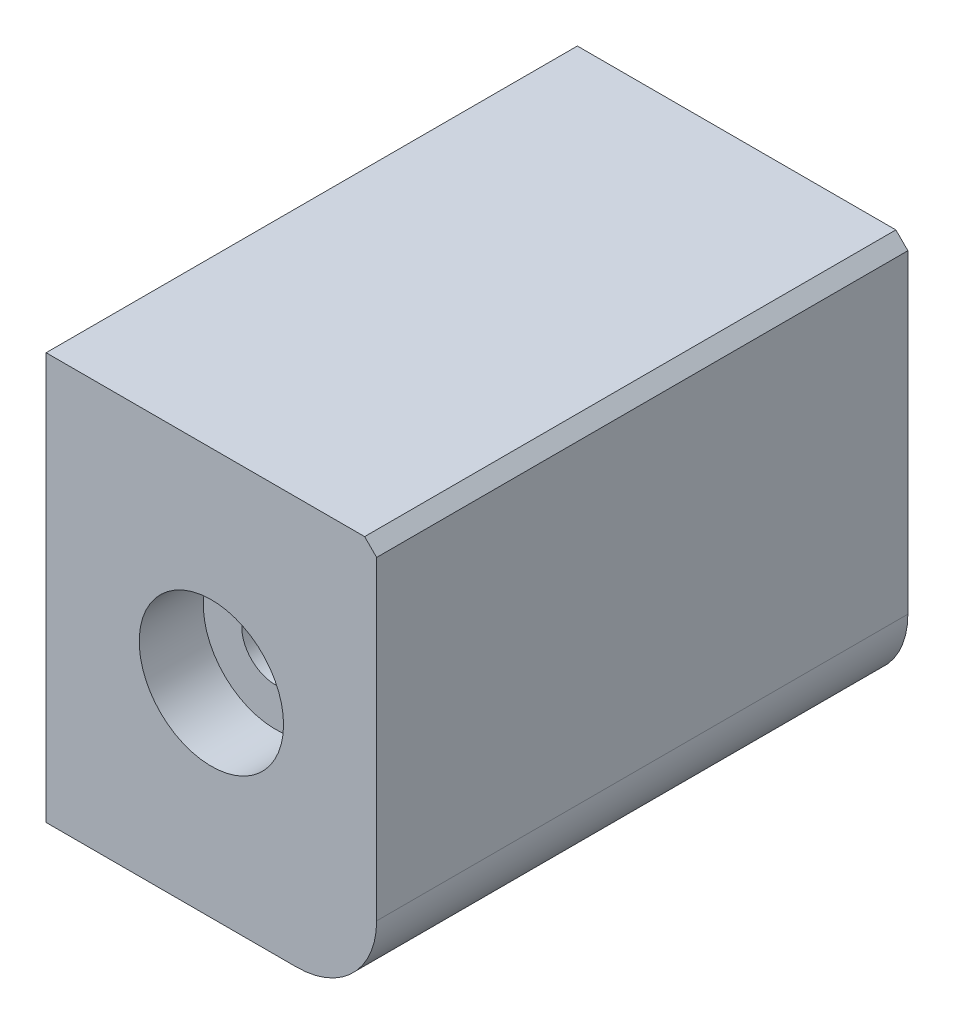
from build123d import *

# Parameters (mm, degrees)
EXTRUDE1_DEPTH     = 66.33
SKETCH2_R          = 9.01
CUT_EXTRUDE1_DEPTH = 8
SKETCH3_R          = 4.2
CUT_EXTRUDE2_DEPTH = 15.5
SKETCH5_R          = 4.2
CUT_EXTRUDE5_DEPTH = 22
CUT_EXTRUDE6_START = -8
SKETCH6_R          = 9.01
SKETCH6_R_2        = 3
CUT_EXTRUDE6_DEPTH = 8
CHAMFER2_SIZE      = 1.5


with BuildPart() as part:
    # Sketch1 → Extrude1 (new body)
    with BuildSketch(Plane.XY):
        with BuildLine():
            Line((41.27, -40.8), (41.27, 0))
            Line((41.27, 0), (0, 0))
            Line((0, 0), (0, -50.8))
            Line((0, -50.8), (31.27, -50.8))
            ThreePointArc((31.27, -50.8), (38.341067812, -47.871067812), (41.27, -40.8))
        make_face()
    extrude(amount=EXTRUDE1_DEPTH)

    # Sketch2 → Cut-Extrude1 (cut)
    with BuildSketch(Plane.XY.offset(66.33)):
        with Locations((20.635, -25.4)):
            Circle(SKETCH2_R)
    extrude(amount=-CUT_EXTRUDE1_DEPTH, mode=Mode.SUBTRACT)

    # Sketch3 → Cut-Extrude2 (cut)
    with BuildSketch(Plane.XY.offset(58.33)):
        with Locations((20.625, -25.4)):
            Circle(SKETCH3_R)
    extrude(amount=-CUT_EXTRUDE2_DEPTH, mode=Mode.SUBTRACT)

    # Cut-Extrude4 cone 1 section (on through the dimple's axis) → Cut-Extrude4 (revolve, cut)
    with BuildSketch(Plane(origin=(20.625, -25.4, 42.83), x_dir=(0, -1, 0), z_dir=(1, 0, 0))):
        Polygon((0, 0), (4.2, 0), (0, 2.424871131), align=None)
    revolve(axis=Axis((20.625, -25.4, 42.83), (0, 0, -1)), mode=Mode.SUBTRACT)

    # Sketch5 → Cut-Extrude5 (cut)
    with BuildSketch(Plane(origin=(0, 0, 0), x_dir=(-1, 0, 0), z_dir=(0, 0, -1))):
        with Locations((-20.635, -25.4)):
            Circle(SKETCH5_R)
    extrude(amount=-CUT_EXTRUDE5_DEPTH, mode=Mode.SUBTRACT)

    # Sketch6 → Cut-Extrude6 (cut)
    with BuildSketch(Plane(origin=(0, 0, 0), x_dir=(-1, 0, 0), z_dir=(0, 0, -1)).offset(CUT_EXTRUDE6_START)):
        with Locations(Location((-20.635, -25.4, 0), (0, 0, 180))):
            Circle(SKETCH6_R)
        with Locations((-20.635, -39.4)):
            Circle(SKETCH6_R_2)
    extrude(amount=CUT_EXTRUDE6_DEPTH, mode=Mode.SUBTRACT)

    # Extrude2 cone 1 section (on through the dimple's axis) → Extrude2 (revolve, cut)
    with BuildSketch(Plane(origin=(20.635, -25.4, 22), x_dir=(0, 1, 0), z_dir=(1, 0, 0))):
        Polygon((0, 0), (4.2, 0), (0, 2.424871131), align=None)
    revolve(axis=Axis((20.635, -25.4, 22), (0, 0, 1)), mode=Mode.SUBTRACT)

    # Chamfer2
    chamfer2_edges = [part.edges().sort_by_distance(p)[0] for p in [
        (41.27, 0, 33.165),
    ]]
    chamfer(chamfer2_edges, length=CHAMFER2_SIZE)


solid = part.part
